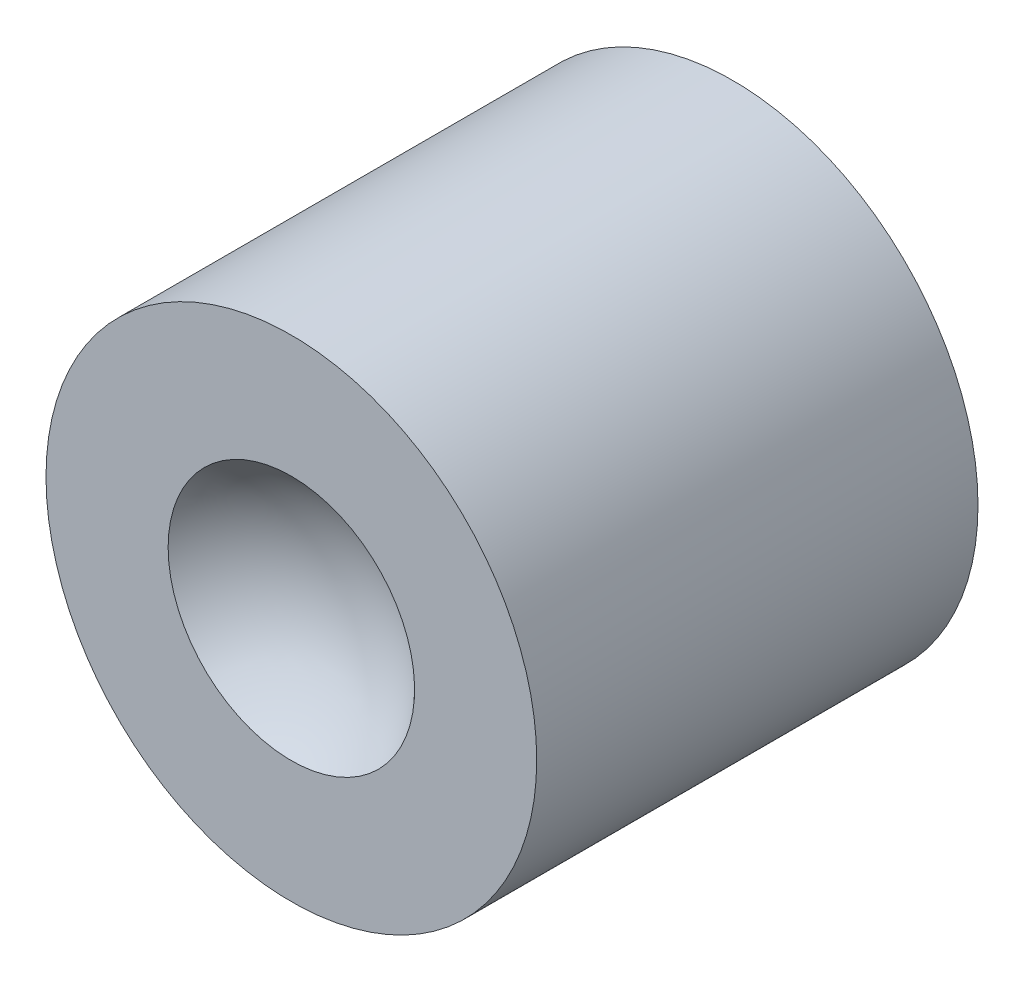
ISO-10303-21;
HEADER;
FILE_DESCRIPTION(('STEP AP214'),'2;1');
FILE_NAME('part.step','',(''),(''),'','','');
FILE_SCHEMA(('AUTOMOTIVE_DESIGN { 1 0 10303 214 1 1 1 1 }'));
ENDSEC;
DATA;
#1=APPLICATION_CONTEXT('core data for automotive mechanical design processes');
#2=APPLICATION_PROTOCOL_DEFINITION('international standard','automotive_design',2000,#1);
#3=PRODUCT_CONTEXT('',#1,'mechanical');
#4=PRODUCT('Part','Part','',(#3));
#5=PRODUCT_RELATED_PRODUCT_CATEGORY('part','',(#4));
#6=PRODUCT_DEFINITION_FORMATION('','',#4);
#7=PRODUCT_DEFINITION_CONTEXT('part definition',#1,'design');
#8=PRODUCT_DEFINITION('design','',#6,#7);
#9=PRODUCT_DEFINITION_SHAPE('','',#8);
#10=(LENGTH_UNIT() NAMED_UNIT(*) SI_UNIT(.MILLI.,.METRE.));
#11=(NAMED_UNIT(*) PLANE_ANGLE_UNIT() SI_UNIT($,.RADIAN.));
#12=(NAMED_UNIT(*) SI_UNIT($,.STERADIAN.) SOLID_ANGLE_UNIT());
#13=UNCERTAINTY_MEASURE_WITH_UNIT(LENGTH_MEASURE(1.E-05),#10,'distance_accuracy_value','');
#14=(GEOMETRIC_REPRESENTATION_CONTEXT(3) GLOBAL_UNCERTAINTY_ASSIGNED_CONTEXT((#13)) GLOBAL_UNIT_ASSIGNED_CONTEXT((#10,
#11,#12)) REPRESENTATION_CONTEXT('',''));
#15=CARTESIAN_POINT('',(0.,0.,0.));
#16=DIRECTION('',(0.,0.,1.));
#17=DIRECTION('',(1.,0.,0.));
#18=AXIS2_PLACEMENT_3D('',#15,#16,#17);
#19=CARTESIAN_POINT('',(-1.77635683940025E-12,0.886524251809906,-2.22044604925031E-13));
#20=DIRECTION('',(0.,0.,-0.999999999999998));
#21=DIRECTION('',(-1.,0.,0.));
#22=AXIS2_PLACEMENT_3D('',#19,#20,#21);
#23=PLANE('',#22);
#24=CARTESIAN_POINT('',(0.,0.,0.));
#25=DIRECTION('',(0.,0.,-0.999999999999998));
#26=DIRECTION('',(-1.,0.,0.));
#27=AXIS2_PLACEMENT_3D('',#24,#25,#26);
#28=CIRCLE('',#27,0.886524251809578);
#29=CARTESIAN_POINT('',(-0.88652425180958,0.,0.));
#30=VERTEX_POINT('',#29);
#31=EDGE_CURVE('E163',#30,#30,#28,.T.);
#32=ORIENTED_EDGE('',*,*,#31,.T.);
#33=EDGE_LOOP('',(#32));
#34=FACE_BOUND('',#33,.T.);
#35=CARTESIAN_POINT('',(0.,0.,0.));
#36=DIRECTION('',(0.,0.,-0.999999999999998));
#37=DIRECTION('',(-1.,0.,0.));
#38=AXIS2_PLACEMENT_3D('',#35,#36,#37);
#39=CIRCLE('',#38,1.7653);
#40=CARTESIAN_POINT('',(-1.7653,0.,0.));
#41=VERTEX_POINT('',#40);
#42=EDGE_CURVE('E201',#41,#41,#39,.T.);
#43=ORIENTED_EDGE('',*,*,#42,.F.);
#44=EDGE_LOOP('',(#43));
#45=FACE_BOUND('',#44,.T.);
#46=ADVANCED_FACE('F38',(#34,#45),#23,.F.);
#47=CARTESIAN_POINT('',(-8.88178419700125E-13,2.66453525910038E-12,0.743882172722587));
#48=DIRECTION('',(0.,0.,-0.999999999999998));
#49=DIRECTION('',(0.,1.,0.));
#50=AXIS2_PLACEMENT_3D('',#47,#48,#49);
#51=SPHERICAL_SURFACE('',#50,1.15727522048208);
#52=ORIENTED_EDGE('',*,*,#31,.F.);
#53=EDGE_LOOP('',(#52));
#54=FACE_BOUND('',#53,.T.);
#55=ADVANCED_FACE('F266',(#54),#51,.F.);
#56=CARTESIAN_POINT('',(0.,0.,0.));
#57=DIRECTION('',(0.,0.,-0.999999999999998));
#58=DIRECTION('',(-1.,0.,0.));
#59=AXIS2_PLACEMENT_3D('',#56,#57,#58);
#60=CYLINDRICAL_SURFACE('',#59,1.7653);
#61=CARTESIAN_POINT('',(2.66453525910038E-12,1.77635683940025E-12,-3.17500000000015));
#62=DIRECTION('',(0.,0.,-0.999999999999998));
#63=DIRECTION('',(-1.,0.,0.));
#64=AXIS2_PLACEMENT_3D('',#61,#62,#63);
#65=CIRCLE('',#64,1.7653);
#66=CARTESIAN_POINT('',(-1.7653,0.,-3.17500000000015));
#67=VERTEX_POINT('',#66);
#68=EDGE_CURVE('E148',#67,#67,#65,.T.);
#69=CARTESIAN_POINT('',(-1.7653,0.,0.));
#70=CARTESIAN_POINT('',(-1.7653,0.,-0.0330729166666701));
#71=CARTESIAN_POINT('',(-1.7653,0.,-0.0661458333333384));
#72=CARTESIAN_POINT('',(-1.7653,0.,-0.132291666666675));
#73=CARTESIAN_POINT('',(-1.7653,0.,-0.165364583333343));
#74=CARTESIAN_POINT('',(-1.7653,0.,-0.231510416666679));
#75=CARTESIAN_POINT('',(-1.7653,0.,-0.264583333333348));
#76=CARTESIAN_POINT('',(-1.7653,0.,-0.330729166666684));
#77=CARTESIAN_POINT('',(-1.7653,0.,-0.363802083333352));
#78=CARTESIAN_POINT('',(-1.7653,0.,-0.429947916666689));
#79=CARTESIAN_POINT('',(-1.7653,0.,-0.463020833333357));
#80=CARTESIAN_POINT('',(-1.7653,0.,-0.529166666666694));
#81=CARTESIAN_POINT('',(-1.7653,0.,-0.562239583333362));
#82=CARTESIAN_POINT('',(-1.7653,0.,-0.628385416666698));
#83=CARTESIAN_POINT('',(-1.7653,0.,-0.661458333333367));
#84=CARTESIAN_POINT('',(-1.7653,0.,-0.727604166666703));
#85=CARTESIAN_POINT('',(-1.7653,0.,-0.760677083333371));
#86=CARTESIAN_POINT('',(-1.7653,0.,-0.826822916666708));
#87=CARTESIAN_POINT('',(-1.7653,0.,-0.859895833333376));
#88=CARTESIAN_POINT('',(-1.7653,0.,-0.926041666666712));
#89=CARTESIAN_POINT('',(-1.7653,0.,-0.959114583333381));
#90=CARTESIAN_POINT('',(-1.7653,0.,-1.02526041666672));
#91=CARTESIAN_POINT('',(-1.7653,0.,-1.05833333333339));
#92=CARTESIAN_POINT('',(-1.7653,0.,-1.12447916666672));
#93=CARTESIAN_POINT('',(-1.7653,0.,-1.15755208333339));
#94=CARTESIAN_POINT('',(-1.7653,0.,-1.22369791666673));
#95=CARTESIAN_POINT('',(-1.7653,0.,-1.25677083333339));
#96=CARTESIAN_POINT('',(-1.7653,0.,-1.32291666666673));
#97=CARTESIAN_POINT('',(-1.7653,0.,-1.3559895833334));
#98=CARTESIAN_POINT('',(-1.7653,0.,-1.42213541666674));
#99=CARTESIAN_POINT('',(-1.7653,0.,-1.4552083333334));
#100=CARTESIAN_POINT('',(-1.7653,0.,-1.52135416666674));
#101=CARTESIAN_POINT('',(-1.7653,0.,-1.55442708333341));
#102=CARTESIAN_POINT('',(-1.7653,0.,-1.62057291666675));
#103=CARTESIAN_POINT('',(-1.7653,0.,-1.65364583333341));
#104=CARTESIAN_POINT('',(-1.7653,0.,-1.71979166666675));
#105=CARTESIAN_POINT('',(-1.7653,0.,-1.75286458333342));
#106=CARTESIAN_POINT('',(-1.7653,0.,-1.81901041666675));
#107=CARTESIAN_POINT('',(-1.7653,0.,-1.85208333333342));
#108=CARTESIAN_POINT('',(-1.7653,0.,-1.91822916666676));
#109=CARTESIAN_POINT('',(-1.7653,0.,-1.95130208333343));
#110=CARTESIAN_POINT('',(-1.7653,0.,-2.01744791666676));
#111=CARTESIAN_POINT('',(-1.7653,0.,-2.05052083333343));
#112=CARTESIAN_POINT('',(-1.7653,0.,-2.11666666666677));
#113=CARTESIAN_POINT('',(-1.7653,0.,-2.14973958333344));
#114=CARTESIAN_POINT('',(-1.7653,0.,-2.21588541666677));
#115=CARTESIAN_POINT('',(-1.7653,0.,-2.24895833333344));
#116=CARTESIAN_POINT('',(-1.7653,0.,-2.31510416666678));
#117=CARTESIAN_POINT('',(-1.7653,0.,-2.34817708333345));
#118=CARTESIAN_POINT('',(-1.7653,0.,-2.41432291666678));
#119=CARTESIAN_POINT('',(-1.7653,0.,-2.44739583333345));
#120=CARTESIAN_POINT('',(-1.7653,0.,-2.51354166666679));
#121=CARTESIAN_POINT('',(-1.7653,0.,-2.54661458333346));
#122=CARTESIAN_POINT('',(-1.7653,0.,-2.61276041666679));
#123=CARTESIAN_POINT('',(-1.7653,0.,-2.64583333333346));
#124=CARTESIAN_POINT('',(-1.7653,0.,-2.7119791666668));
#125=CARTESIAN_POINT('',(-1.7653,0.,-2.74505208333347));
#126=CARTESIAN_POINT('',(-1.7653,0.,-2.8111979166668));
#127=CARTESIAN_POINT('',(-1.7653,0.,-2.84427083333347));
#128=CARTESIAN_POINT('',(-1.7653,0.,-2.91041666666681));
#129=CARTESIAN_POINT('',(-1.7653,0.,-2.94348958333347));
#130=CARTESIAN_POINT('',(-1.7653,0.,-3.00963541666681));
#131=CARTESIAN_POINT('',(-1.7653,0.,-3.04270833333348));
#132=CARTESIAN_POINT('',(-1.7653,0.,-3.10885416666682));
#133=CARTESIAN_POINT('',(-1.7653,0.,-3.14192708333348));
#134=CARTESIAN_POINT('',(-1.7653,0.,-3.17500000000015));
#135=B_SPLINE_CURVE_WITH_KNOTS('',3,(#69,#70,#71,#72,#73,#74,#75,#76,#77,#78,#79,#80,#81,#82,
#83,#84,#85,#86,#87,#88,#89,#90,#91,#92,#93,#94,#95,#96,#97,#98,#99,#100,#101,#102,#103,#104,
#105,#106,#107,#108,#109,#110,#111,#112,#113,#114,#115,#116,#117,#118,#119,#120,#121,#122,#123,
#124,#125,#126,#127,#128,#129,#130,#131,#132,#133,#134),.UNSPECIFIED.,.F.,.F.,(4,2,2,2,2,2,2,2,
2,2,2,2,2,2,2,2,2,2,2,2,2,2,2,2,2,2,2,2,2,2,2,2,4),(0.,0.0992187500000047,0.198437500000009,
0.297656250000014,0.396875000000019,0.496093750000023,0.595312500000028,0.694531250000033,
0.793750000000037,0.892968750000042,0.992187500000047,1.09140625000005,1.19062500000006,
1.28984375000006,1.38906250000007,1.48828125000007,1.58750000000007,1.68671875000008,
1.78593750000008,1.88515625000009,1.98437500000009,2.0835937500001,2.1828125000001,
2.28203125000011,2.38125000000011,2.48046875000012,2.57968750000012,2.67890625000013,
2.77812500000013,2.87734375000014,2.97656250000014,3.07578125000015,3.17500000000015),.UNSPECIFIED.);
#136=EDGE_CURVE('BSEAM270',#41,#67,#135,.T.);
#137=ORIENTED_EDGE('',*,*,#42,.T.);
#138=ORIENTED_EDGE('',*,*,#68,.F.);
#139=ORIENTED_EDGE('',*,*,#136,.T.);
#140=ORIENTED_EDGE('',*,*,#136,.F.);
#141=EDGE_LOOP('',(#137,#139,#138,#140));
#142=FACE_BOUND('',#141,.T.);
#143=ADVANCED_FACE('F270',(#142),#60,.T.);
#144=CARTESIAN_POINT('',(2.66453525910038E-12,1.77635683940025E-12,-3.17500000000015));
#145=DIRECTION('',(0.,0.,0.999999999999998));
#146=DIRECTION('',(1.,0.,0.));
#147=AXIS2_PLACEMENT_3D('',#144,#145,#146);
#148=PLANE('',#147);
#149=CARTESIAN_POINT('',(2.66453525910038E-12,1.77635683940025E-12,-3.17500000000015));
#150=DIRECTION('',(0.,0.,-0.999999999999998));
#151=DIRECTION('',(-1.,0.,0.));
#152=AXIS2_PLACEMENT_3D('',#149,#150,#151);
#153=CIRCLE('',#152,0.9144);
#154=CARTESIAN_POINT('',(-0.00372588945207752,0.91439240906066,-3.17500000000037));
#155=VERTEX_POINT('',#154);
#156=CARTESIAN_POINT('',(0.00372588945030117,0.914392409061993,-3.17500000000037));
#157=VERTEX_POINT('',#156);
#158=EDGE_CURVE('E149',#155,#157,#153,.T.);
#159=ORIENTED_EDGE('',*,*,#158,.F.);
#160=DIRECTION('',(0.86602540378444,0.5,0.));
#161=VECTOR('',#160,1.);
#162=CARTESIAN_POINT('',(-0.793749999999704,0.458271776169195,-3.17499999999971));
#163=LINE('',#162,#161);
#164=CARTESIAN_POINT('',(-0.790024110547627,0.460422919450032,-3.17500000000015));
#165=VERTEX_POINT('',#164);
#166=EDGE_CURVE('E147',#165,#155,#163,.T.);
#167=ORIENTED_EDGE('',*,*,#166,.F.);
#168=CARTESIAN_POINT('',(-0.793749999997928,0.453969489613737,-3.17500000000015));
#169=VERTEX_POINT('',#168);
#170=EDGE_CURVE('E130',#169,#165,#153,.T.);
#171=ORIENTED_EDGE('',*,*,#170,.F.);
#172=DIRECTION('',(0.,1.,0.));
#173=VECTOR('',#172,1.);
#174=CARTESIAN_POINT('',(-0.793750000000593,-0.458271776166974,-3.17500000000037));
#175=LINE('',#174,#173);
#176=CARTESIAN_POINT('',(-0.793749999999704,-0.453969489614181,-3.17500000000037));
#177=VERTEX_POINT('',#176);
#178=EDGE_CURVE('E145',#177,#169,#175,.T.);
#179=ORIENTED_EDGE('',*,*,#178,.F.);
#180=CARTESIAN_POINT('',(-0.790024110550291,-0.460422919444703,-3.17500000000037));
#181=VERTEX_POINT('',#180);
#182=EDGE_CURVE('E151',#181,#177,#153,.T.);
#183=ORIENTED_EDGE('',*,*,#182,.F.);
#184=DIRECTION('',(-0.86602540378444,0.500000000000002,0.));
#185=VECTOR('',#184,1.);
#186=CARTESIAN_POINT('',(-2.66453525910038E-12,-0.916543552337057,-3.17500000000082));
#187=LINE('',#186,#185);
#188=CARTESIAN_POINT('',(-0.00372588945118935,-0.91439240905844,-3.17500000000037));
#189=VERTEX_POINT('',#188);
#190=EDGE_CURVE('E154',#189,#181,#187,.T.);
#191=ORIENTED_EDGE('',*,*,#190,.F.);
#192=CARTESIAN_POINT('',(0.00372588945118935,-0.914392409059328,-3.17499999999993));
#193=VERTEX_POINT('',#192);
#194=EDGE_CURVE('E198',#193,#189,#153,.T.);
#195=ORIENTED_EDGE('',*,*,#194,.F.);
#196=DIRECTION('',(-0.86602540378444,-0.5,0.));
#197=VECTOR('',#196,1.);
#198=CARTESIAN_POINT('',(0.793750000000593,-0.45827177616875,-3.17499999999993));
#199=LINE('',#198,#197);
#200=CARTESIAN_POINT('',(0.790024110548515,-0.460422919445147,-3.17500000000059));
#201=VERTEX_POINT('',#200);
#202=EDGE_CURVE('E160',#201,#193,#199,.T.);
#203=ORIENTED_EDGE('',*,*,#202,.F.);
#204=CARTESIAN_POINT('',(0.793749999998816,-0.453969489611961,-3.17500000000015));
#205=VERTEX_POINT('',#204);
#206=EDGE_CURVE('E196',#205,#201,#153,.T.);
#207=ORIENTED_EDGE('',*,*,#206,.F.);
#208=DIRECTION('',(0.,-1.,0.));
#209=VECTOR('',#208,1.);
#210=CARTESIAN_POINT('',(0.793749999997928,0.458271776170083,-3.17499999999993));
#211=LINE('',#210,#209);
#212=CARTESIAN_POINT('',(0.793749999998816,0.453969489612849,-3.17500000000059));
#213=VERTEX_POINT('',#212);
#214=EDGE_CURVE('E181',#213,#205,#211,.T.);
#215=ORIENTED_EDGE('',*,*,#214,.F.);
#216=CARTESIAN_POINT('',(0.790024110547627,0.460422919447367,-3.17500000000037));
#217=VERTEX_POINT('',#216);
#218=EDGE_CURVE('E199',#217,#213,#153,.T.);
#219=ORIENTED_EDGE('',*,*,#218,.F.);
#220=DIRECTION('',(0.86602540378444,-0.500000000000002,0.));
#221=VECTOR('',#220,1.);
#222=CARTESIAN_POINT('',(-8.88178419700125E-13,0.916543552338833,-3.17499999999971));
#223=LINE('',#222,#221);
#224=EDGE_CURVE('E178',#157,#217,#223,.T.);
#225=ORIENTED_EDGE('',*,*,#224,.F.);
#226=EDGE_LOOP('',(#159,#167,#171,#179,#183,#191,#195,#203,#207,#215,#219,#225));
#227=FACE_BOUND('',#226,.T.);
#228=ORIENTED_EDGE('',*,*,#68,.T.);
#229=EDGE_LOOP('',(#228));
#230=FACE_BOUND('',#229,.T.);
#231=ADVANCED_FACE('F40',(#227,#230),#148,.F.);
#232=CARTESIAN_POINT('',(0.793750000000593,1.37481532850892,-2.38125000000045));
#233=DIRECTION('',(0.,0.,-0.999999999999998));
#234=DIRECTION('',(-1.,0.,0.));
#235=AXIS2_PLACEMENT_3D('',#232,#233,#234);
#236=PLANE('',#235);
#237=DIRECTION('',(0.,1.,0.));
#238=VECTOR('',#237,1.);
#239=CARTESIAN_POINT('',(-0.793750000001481,-0.45827177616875,-2.38124999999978));
#240=LINE('',#239,#238);
#241=CARTESIAN_POINT('',(-0.793750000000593,-0.453969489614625,-2.38125000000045));
#242=VERTEX_POINT('',#241);
#243=CARTESIAN_POINT('',(-0.793750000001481,0.453969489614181,-2.38125000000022));
#244=VERTEX_POINT('',#243);
#245=EDGE_CURVE('E165',#242,#244,#240,.T.);
#246=ORIENTED_EDGE('',*,*,#245,.T.);
#247=CARTESIAN_POINT('',(8.88178419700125E-13,0.,-2.38125));
#248=DIRECTION('',(0.,0.,-0.999999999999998));
#249=DIRECTION('',(-1.,0.,0.));
#250=AXIS2_PLACEMENT_3D('',#247,#248,#249);
#251=CIRCLE('',#250,0.9144);
#252=CARTESIAN_POINT('',(-0.790024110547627,0.460422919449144,-2.38125000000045));
#253=VERTEX_POINT('',#252);
#254=EDGE_CURVE('E11',#244,#253,#251,.T.);
#255=ORIENTED_EDGE('',*,*,#254,.T.);
#256=DIRECTION('',(0.86602540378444,0.5,0.));
#257=VECTOR('',#256,1.);
#258=CARTESIAN_POINT('',(-0.793750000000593,0.458271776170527,-2.38125000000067));
#259=LINE('',#258,#257);
#260=CARTESIAN_POINT('',(-0.00372588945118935,0.914392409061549,-2.38124999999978));
#261=VERTEX_POINT('',#260);
#262=EDGE_CURVE('E153',#253,#261,#259,.T.);
#263=ORIENTED_EDGE('',*,*,#262,.T.);
#264=CARTESIAN_POINT('',(0.00372588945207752,0.914392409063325,-2.38124999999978));
#265=VERTEX_POINT('',#264);
#266=EDGE_CURVE('E47',#261,#265,#251,.T.);
#267=ORIENTED_EDGE('',*,*,#266,.T.);
#268=DIRECTION('',(0.86602540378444,-0.500000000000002,0.));
#269=VECTOR('',#268,1.);
#270=CARTESIAN_POINT('',(8.88178419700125E-13,0.916543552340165,-2.38125000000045));
#271=LINE('',#270,#269);
#272=CARTESIAN_POINT('',(0.790024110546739,0.460422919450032,-2.38124999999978));
#273=VERTEX_POINT('',#272);
#274=EDGE_CURVE('E157',#265,#273,#271,.T.);
#275=ORIENTED_EDGE('',*,*,#274,.T.);
#276=CARTESIAN_POINT('',(0.793749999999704,0.453969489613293,-2.38125000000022));
#277=VERTEX_POINT('',#276);
#278=EDGE_CURVE('E234',#273,#277,#251,.T.);
#279=ORIENTED_EDGE('',*,*,#278,.T.);
#280=DIRECTION('',(0.,-1.,0.));
#281=VECTOR('',#280,1.);
#282=CARTESIAN_POINT('',(0.793749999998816,0.458271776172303,-2.38124999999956));
#283=LINE('',#282,#281);
#284=CARTESIAN_POINT('',(0.793749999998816,-0.453969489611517,-2.38125));
#285=VERTEX_POINT('',#284);
#286=EDGE_CURVE('E224',#277,#285,#283,.T.);
#287=ORIENTED_EDGE('',*,*,#286,.T.);
#288=CARTESIAN_POINT('',(0.790024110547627,-0.460422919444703,-2.38124999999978));
#289=VERTEX_POINT('',#288);
#290=EDGE_CURVE('E229',#285,#289,#251,.T.);
#291=ORIENTED_EDGE('',*,*,#290,.T.);
#292=DIRECTION('',(-0.86602540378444,-0.5,0.));
#293=VECTOR('',#292,1.);
#294=CARTESIAN_POINT('',(0.793750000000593,-0.458271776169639,-2.38125));
#295=LINE('',#294,#293);
#296=CARTESIAN_POINT('',(0.00372588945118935,-0.914392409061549,-2.38125000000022));
#297=VERTEX_POINT('',#296);
#298=EDGE_CURVE('E173',#289,#297,#295,.T.);
#299=ORIENTED_EDGE('',*,*,#298,.T.);
#300=CARTESIAN_POINT('',(-0.00372588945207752,-0.914392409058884,-2.38125000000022));
#301=VERTEX_POINT('',#300);
#302=EDGE_CURVE('E168',#297,#301,#251,.T.);
#303=ORIENTED_EDGE('',*,*,#302,.T.);
#304=DIRECTION('',(-0.86602540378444,0.500000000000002,0.));
#305=VECTOR('',#304,1.);
#306=CARTESIAN_POINT('',(-8.88178419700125E-13,-0.916543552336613,-2.38125000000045));
#307=LINE('',#306,#305);
#308=CARTESIAN_POINT('',(-0.790024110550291,-0.460422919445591,-2.38125));
#309=VERTEX_POINT('',#308);
#310=EDGE_CURVE('E169',#301,#309,#307,.T.);
#311=ORIENTED_EDGE('',*,*,#310,.T.);
#312=EDGE_CURVE('E42',#309,#242,#251,.T.);
#313=ORIENTED_EDGE('',*,*,#312,.T.);
#314=EDGE_LOOP('',(#246,#255,#263,#267,#275,#279,#287,#291,#299,#303,#311,#313));
#315=FACE_BOUND('',#314,.T.);
#316=ADVANCED_FACE('F227',(#315),#236,.T.);
#317=CARTESIAN_POINT('',(8.88178419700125E-13,0.916543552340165,-2.38125000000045));
#318=DIRECTION('',(0.499999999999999,0.866025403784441,0.));
#319=DIRECTION('',(-0.86602540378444,0.500000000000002,0.));
#320=AXIS2_PLACEMENT_3D('',#317,#318,#319);
#321=PLANE('',#320);
#322=DIRECTION('',(0.,0.,-0.999999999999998));
#323=VECTOR('',#322,1.);
#324=CARTESIAN_POINT('',(0.790024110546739,0.4604229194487,0.));
#325=LINE('',#324,#323);
#326=EDGE_CURVE('E214',#273,#217,#325,.T.);
#327=ORIENTED_EDGE('',*,*,#326,.F.);
#328=ORIENTED_EDGE('',*,*,#274,.F.);
#329=DIRECTION('',(0.,0.,-0.999999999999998));
#330=VECTOR('',#329,1.);
#331=CARTESIAN_POINT('',(0.00372588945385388,0.914392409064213,0.));
#332=LINE('',#331,#330);
#333=EDGE_CURVE('E218',#157,#265,#332,.F.);
#334=ORIENTED_EDGE('',*,*,#333,.F.);
#335=ORIENTED_EDGE('',*,*,#224,.T.);
#336=EDGE_LOOP('',(#327,#328,#334,#335));
#337=FACE_BOUND('',#336,.T.);
#338=ADVANCED_FACE('F243',(#337),#321,.F.);
#339=CARTESIAN_POINT('',(0.793749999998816,0.458271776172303,-2.38124999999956));
#340=DIRECTION('',(1.,0.,0.));
#341=DIRECTION('',(0.,0.,-0.999999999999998));
#342=AXIS2_PLACEMENT_3D('',#339,#340,#341);
#343=PLANE('',#342);
#344=DIRECTION('',(0.,0.,-0.999999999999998));
#345=VECTOR('',#344,1.);
#346=CARTESIAN_POINT('',(0.793749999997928,-0.453969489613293,-2.22044604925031E-13));
#347=LINE('',#346,#345);
#348=EDGE_CURVE('E211',#285,#205,#347,.T.);
#349=ORIENTED_EDGE('',*,*,#348,.F.);
#350=ORIENTED_EDGE('',*,*,#286,.F.);
#351=DIRECTION('',(0.,0.,-0.999999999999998));
#352=VECTOR('',#351,1.);
#353=CARTESIAN_POINT('',(0.793749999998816,0.453969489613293,-4.44089209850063E-13));
#354=LINE('',#353,#352);
#355=EDGE_CURVE('E216',#213,#277,#354,.F.);
#356=ORIENTED_EDGE('',*,*,#355,.F.);
#357=ORIENTED_EDGE('',*,*,#214,.T.);
#358=EDGE_LOOP('',(#349,#350,#356,#357));
#359=FACE_BOUND('',#358,.T.);
#360=ADVANCED_FACE('F287',(#359),#343,.F.);
#361=CARTESIAN_POINT('',(0.793750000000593,-0.458271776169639,-2.38125));
#362=DIRECTION('',(0.500000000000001,-0.866025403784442,0.));
#363=DIRECTION('',(0.86602540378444,0.5,0.));
#364=AXIS2_PLACEMENT_3D('',#361,#362,#363);
#365=PLANE('',#364);
#366=DIRECTION('',(0.,0.,-0.999999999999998));
#367=VECTOR('',#366,1.);
#368=CARTESIAN_POINT('',(0.00372588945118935,-0.914392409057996,-2.22044604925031E-13));
#369=LINE('',#368,#367);
#370=EDGE_CURVE('E190',#297,#193,#369,.T.);
#371=ORIENTED_EDGE('',*,*,#370,.F.);
#372=ORIENTED_EDGE('',*,*,#298,.F.);
#373=DIRECTION('',(0.,0.,-0.999999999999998));
#374=VECTOR('',#373,1.);
#375=CARTESIAN_POINT('',(0.790024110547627,-0.460422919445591,2.22044604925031E-13));
#376=LINE('',#375,#374);
#377=EDGE_CURVE('E192',#201,#289,#376,.F.);
#378=ORIENTED_EDGE('',*,*,#377,.F.);
#379=ORIENTED_EDGE('',*,*,#202,.T.);
#380=EDGE_LOOP('',(#371,#372,#378,#379));
#381=FACE_BOUND('',#380,.T.);
#382=ADVANCED_FACE('F188',(#381),#365,.F.);
#383=CARTESIAN_POINT('',(-8.88178419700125E-13,-0.916543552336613,-2.38125000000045));
#384=DIRECTION('',(-0.499999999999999,-0.866025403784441,0.));
#385=DIRECTION('',(0.86602540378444,-0.500000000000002,0.));
#386=AXIS2_PLACEMENT_3D('',#383,#384,#385);
#387=PLANE('',#386);
#388=DIRECTION('',(0.,0.,-0.999999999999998));
#389=VECTOR('',#388,1.);
#390=CARTESIAN_POINT('',(-0.790024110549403,-0.460422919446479,-2.22044604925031E-13));
#391=LINE('',#390,#389);
#392=EDGE_CURVE('E204',#309,#181,#391,.T.);
#393=ORIENTED_EDGE('',*,*,#392,.F.);
#394=ORIENTED_EDGE('',*,*,#310,.F.);
#395=DIRECTION('',(0.,0.,-0.999999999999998));
#396=VECTOR('',#395,1.);
#397=CARTESIAN_POINT('',(-0.00372588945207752,-0.914392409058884,-2.22044604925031E-13));
#398=LINE('',#397,#396);
#399=EDGE_CURVE('E62',#189,#301,#398,.F.);
#400=ORIENTED_EDGE('',*,*,#399,.F.);
#401=ORIENTED_EDGE('',*,*,#190,.T.);
#402=EDGE_LOOP('',(#393,#394,#400,#401));
#403=FACE_BOUND('',#402,.T.);
#404=ADVANCED_FACE('F261',(#403),#387,.F.);
#405=CARTESIAN_POINT('',(-0.793750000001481,-0.45827177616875,-2.38124999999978));
#406=DIRECTION('',(-1.,0.,0.));
#407=DIRECTION('',(0.,-1.,0.));
#408=AXIS2_PLACEMENT_3D('',#405,#406,#407);
#409=PLANE('',#408);
#410=DIRECTION('',(0.,0.,-0.999999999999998));
#411=VECTOR('',#410,1.);
#412=CARTESIAN_POINT('',(-0.793750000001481,0.453969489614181,-4.44089209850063E-13));
#413=LINE('',#412,#411);
#414=EDGE_CURVE('E127',#244,#169,#413,.T.);
#415=ORIENTED_EDGE('',*,*,#414,.F.);
#416=ORIENTED_EDGE('',*,*,#245,.F.);
#417=DIRECTION('',(0.,0.,-0.999999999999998));
#418=VECTOR('',#417,1.);
#419=CARTESIAN_POINT('',(-0.793749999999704,-0.453969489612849,-4.44089209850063E-13));
#420=LINE('',#419,#418);
#421=EDGE_CURVE('E54',#177,#242,#420,.F.);
#422=ORIENTED_EDGE('',*,*,#421,.F.);
#423=ORIENTED_EDGE('',*,*,#178,.T.);
#424=EDGE_LOOP('',(#415,#416,#422,#423));
#425=FACE_BOUND('',#424,.T.);
#426=ADVANCED_FACE('F152',(#425),#409,.F.);
#427=CARTESIAN_POINT('',(-0.793750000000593,0.458271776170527,-2.38125000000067));
#428=DIRECTION('',(-0.500000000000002,0.866025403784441,0.));
#429=DIRECTION('',(-0.86602540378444,-0.5,0.));
#430=AXIS2_PLACEMENT_3D('',#427,#428,#429);
#431=PLANE('',#430);
#432=DIRECTION('',(0.,0.,-0.999999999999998));
#433=VECTOR('',#432,1.);
#434=CARTESIAN_POINT('',(-0.00372588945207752,0.914392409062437,0.));
#435=LINE('',#434,#433);
#436=EDGE_CURVE('E137',#261,#155,#435,.T.);
#437=ORIENTED_EDGE('',*,*,#436,.F.);
#438=ORIENTED_EDGE('',*,*,#262,.F.);
#439=DIRECTION('',(0.,0.,-0.999999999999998));
#440=VECTOR('',#439,1.);
#441=CARTESIAN_POINT('',(-0.790024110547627,0.460422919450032,-2.22044604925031E-13));
#442=LINE('',#441,#440);
#443=EDGE_CURVE('E136',#165,#253,#442,.F.);
#444=ORIENTED_EDGE('',*,*,#443,.F.);
#445=ORIENTED_EDGE('',*,*,#166,.T.);
#446=EDGE_LOOP('',(#437,#438,#444,#445));
#447=FACE_BOUND('',#446,.T.);
#448=ADVANCED_FACE('F251',(#447),#431,.F.);
#449=CARTESIAN_POINT('',(0.,0.,0.));
#450=DIRECTION('',(0.,0.,-0.999999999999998));
#451=DIRECTION('',(-1.,0.,0.));
#452=AXIS2_PLACEMENT_3D('',#449,#450,#451);
#453=CYLINDRICAL_SURFACE('',#452,0.9144);
#454=ORIENTED_EDGE('',*,*,#182,.T.);
#455=ORIENTED_EDGE('',*,*,#421,.T.);
#456=ORIENTED_EDGE('',*,*,#312,.F.);
#457=ORIENTED_EDGE('',*,*,#392,.T.);
#458=EDGE_LOOP('',(#454,#455,#456,#457));
#459=FACE_BOUND('',#458,.T.);
#460=ADVANCED_FACE('F253',(#459),#453,.F.);
#461=ORIENTED_EDGE('',*,*,#194,.T.);
#462=ORIENTED_EDGE('',*,*,#399,.T.);
#463=ORIENTED_EDGE('',*,*,#302,.F.);
#464=ORIENTED_EDGE('',*,*,#370,.T.);
#465=EDGE_LOOP('',(#461,#462,#463,#464));
#466=FACE_BOUND('',#465,.T.);
#467=ADVANCED_FACE('F259',(#466),#453,.F.);
#468=ORIENTED_EDGE('',*,*,#206,.T.);
#469=ORIENTED_EDGE('',*,*,#377,.T.);
#470=ORIENTED_EDGE('',*,*,#290,.F.);
#471=ORIENTED_EDGE('',*,*,#348,.T.);
#472=EDGE_LOOP('',(#468,#469,#470,#471));
#473=FACE_BOUND('',#472,.T.);
#474=ADVANCED_FACE('F298',(#473),#453,.F.);
#475=ORIENTED_EDGE('',*,*,#218,.T.);
#476=ORIENTED_EDGE('',*,*,#355,.T.);
#477=ORIENTED_EDGE('',*,*,#278,.F.);
#478=ORIENTED_EDGE('',*,*,#326,.T.);
#479=EDGE_LOOP('',(#475,#476,#477,#478));
#480=FACE_BOUND('',#479,.T.);
#481=ADVANCED_FACE('F247',(#480),#453,.F.);
#482=ORIENTED_EDGE('',*,*,#266,.F.);
#483=ORIENTED_EDGE('',*,*,#436,.T.);
#484=ORIENTED_EDGE('',*,*,#158,.T.);
#485=ORIENTED_EDGE('',*,*,#333,.T.);
#486=EDGE_LOOP('',(#482,#483,#484,#485));
#487=FACE_BOUND('',#486,.T.);
#488=ADVANCED_FACE('F249',(#487),#453,.F.);
#489=ORIENTED_EDGE('',*,*,#170,.T.);
#490=ORIENTED_EDGE('',*,*,#443,.T.);
#491=ORIENTED_EDGE('',*,*,#254,.F.);
#492=ORIENTED_EDGE('',*,*,#414,.T.);
#493=EDGE_LOOP('',(#489,#490,#491,#492));
#494=FACE_BOUND('',#493,.T.);
#495=ADVANCED_FACE('F129',(#494),#453,.F.);
#496=CLOSED_SHELL('',(#46,#55,#143,#231,#316,#338,#360,#382,#404,#426,#448,#460,#467,#474,#481,
#488,#495));
#497=MANIFOLD_SOLID_BREP('B2',#496);
#498=ADVANCED_BREP_SHAPE_REPRESENTATION('',(#18,#497),#14);
#499=SHAPE_DEFINITION_REPRESENTATION(#9,#498);
ENDSEC;
END-ISO-10303-21;
